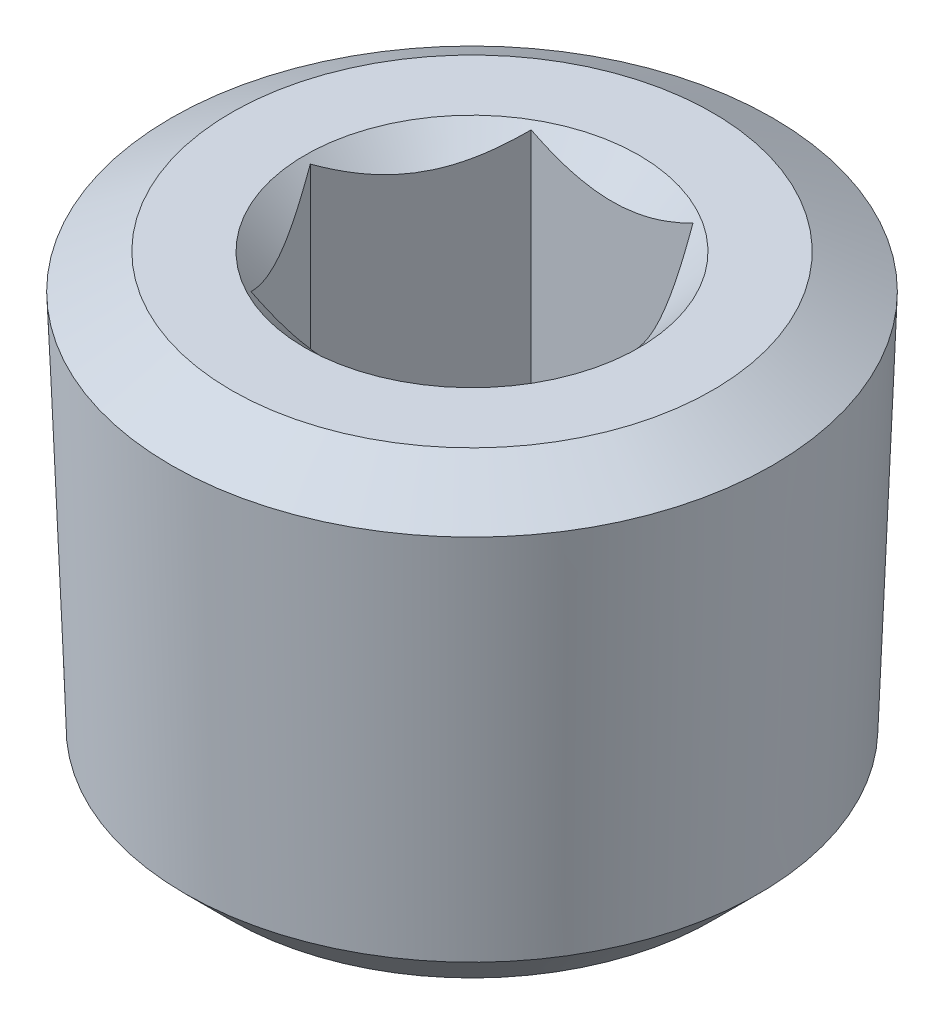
from build123d import *

# Parameters (mm, degrees)
CUT_EXTRUDE1_START = -8.128
CUT_EXTRUDE1_DEPTH = 7.98095


with BuildPart() as part:
    # Sketch2 → Revolve1 (revolve)
    with BuildSketch(Plane.XY, mode=Mode.PRIVATE) as revolve1_sk:
        Polygon((0, 0), (-6.827436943, 0), (-8.536524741, -0.9867423), (-8.145491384, -11.712145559), (-6.827436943, -13.0302), (0, -13.0302), align=None)
    revolve(revolve1_sk.sketch.rotate(Axis((0, 10.744282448, 0), (0, -1, 0)), 270), axis=Axis((0, 10.744282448, 0), (0, -1, 0)))

    # Sketch3 → Cut-Revolve1 (revolve, cut)
    with BuildSketch(Plane.XY, mode=Mode.PRIVATE) as cut_revolve1_sk:
        Polygon((0, 0), (-4.7371, 0), (-3.9751, -0.762), (-3.9751, -8.128), (-0.593284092, -10.16), (0, -10.16), align=None)
    revolve(cut_revolve1_sk.sketch.rotate(Axis((0, 2.934222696, 0), (0, -1, 0)), 270), axis=Axis((0, 2.934222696, 0), (0, -1, 0)), mode=Mode.SUBTRACT)

    # Sketch4 → Cut-Extrude1 (cut)
    with BuildSketch(Plane(origin=(0, 0, 0), x_dir=(1, 0, 0), z_dir=(0, 1, 0)).offset(CUT_EXTRUDE1_START)):
        Polygon((-2.295025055, -3.9751), (2.295025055, -3.9751), (4.59005011, 0), (2.295025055, 3.9751), (-2.295025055, 3.9751), (-4.59005011, 0), align=None)
    extrude(amount=CUT_EXTRUDE1_DEPTH, mode=Mode.SUBTRACT)


solid = part.part
